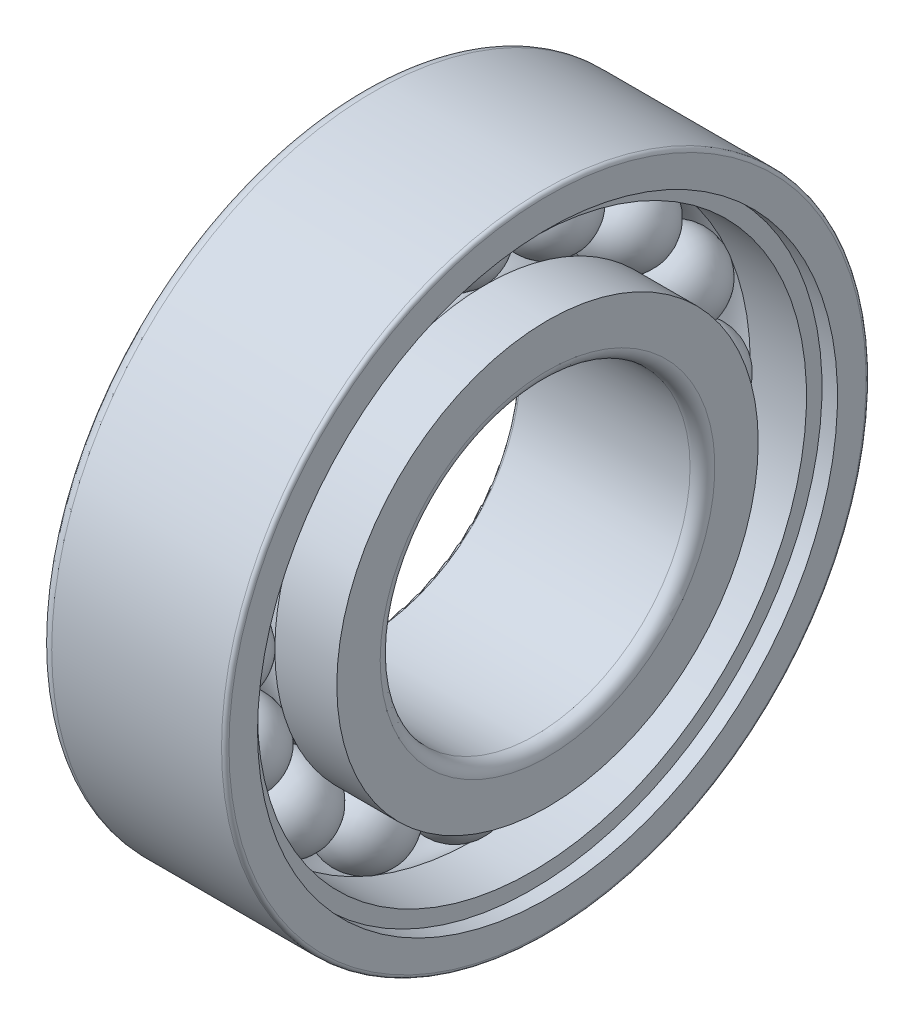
from build123d import *

# Parameters (mm, degrees)
CIRCULAR_PATTERN1_COUNT = 16
FILLET1_R               = 1
FILLET2_R               = 0.3


with BuildPart() as part:
    # Sketch1 → Revolve1 (revolve)
    with BuildSketch(Plane.XY):
        with BuildLine():
            Line((-3.375, 19.25), (3.375, 19.25))
            ThreePointArc((3.375, 19.25), (0, 15.875), (-3.375, 19.25))
        make_face()
    revolve1 = revolve(axis=Axis((-3.091912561, 19.25, 0), (1, 0, 0)))

    # Sketch2 → Revolve2 (revolve)
    with BuildSketch(Plane.XY, mode=Mode.PRIVATE) as revolve2_sk:
        with BuildLine():
            Line((-7.5, 17), (-2.502144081, 17))
            ThreePointArc((-2.502144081, 17), (0, 15.885), (2.502144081, 17))
            Line((2.502144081, 17), (7.5, 17))
            Line((7.5, 17), (7.5, 12.5))
            Line((7.5, 12.5), (-7.5, 12.5))
            Line((-7.5, 12.5), (-7.5, 17))
        make_face()
    revolve(revolve2_sk.sketch.rotate(Axis((-2.992358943, 0, 0), (1, 0, 0)), 90), axis=Axis((-2.992358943, 0, 0), (1, 0, 0)))

    # Sketch3 → Revolve3 (revolve)
    with BuildSketch(Plane.XY, mode=Mode.PRIVATE) as revolve3_sk:
        with BuildLine():
            Line((-7.5, 21.5), (-7.5, 26))
            Line((-7.5, 26), (7.5, 26))
            Line((7.5, 26), (7.5, 23.395))
            Line((7.5, 23.395), (6.25, 23.395))
            Line((6.25, 23.395), (6.25, 22.145))
            Line((6.25, 22.145), (1.715284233, 22.145))
            ThreePointArc((1.715284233, 22.145), (-0.508717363, 22.576324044), (-2.502144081, 21.5))
            Line((-2.502144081, 21.5), (-7.5, 21.5))
        make_face()
    revolve(revolve3_sk.sketch.rotate(Axis((-2.992358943, 0, 0), (1, 0, 0)), 90), axis=Axis((-2.992358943, 0, 0), (1, 0, 0)))

    # Circular-Pattern1: Revolve1 ×16 about axis
    circular_pattern1_axis = Axis((0, 0, 0), (1, 0, 0))
    for i in range(1, CIRCULAR_PATTERN1_COUNT):
        add(revolve1.rotate(circular_pattern1_axis, i * 360 / CIRCULAR_PATTERN1_COUNT))

    # Fillet1
    fillet1_edges = [part.edges().sort_by_distance(p)[0] for p in [
        (-7.5, 0, -26),
        (7.5, 0, -12.5),
    ]]
    fillet(fillet1_edges, radius=FILLET1_R)

    # Fillet2
    fillet2_edges = [part.edges().sort_by_distance(p)[0] for p in [
        (7.5, 0, -26),
        (-7.5, 0, -12.5),
    ]]
    fillet(fillet2_edges, radius=FILLET2_R)


solid = part.part
